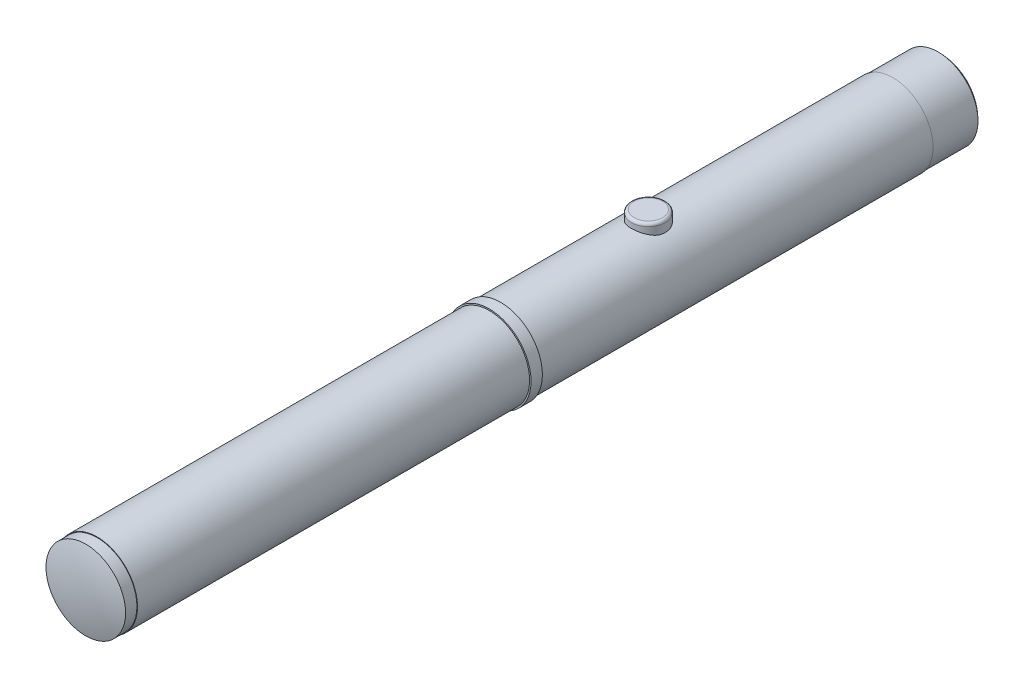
ISO-10303-21;
HEADER;
FILE_DESCRIPTION(('STEP AP214'),'2;1');
FILE_NAME('part.step','',(''),(''),'','','');
FILE_SCHEMA(('AUTOMOTIVE_DESIGN { 1 0 10303 214 1 1 1 1 }'));
ENDSEC;
DATA;
#1=APPLICATION_CONTEXT('core data for automotive mechanical design processes');
#2=APPLICATION_PROTOCOL_DEFINITION('international standard','automotive_design',2000,#1);
#3=PRODUCT_CONTEXT('',#1,'mechanical');
#4=PRODUCT('Part','Part','',(#3));
#5=PRODUCT_RELATED_PRODUCT_CATEGORY('part','',(#4));
#6=PRODUCT_DEFINITION_FORMATION('','',#4);
#7=PRODUCT_DEFINITION_CONTEXT('part definition',#1,'design');
#8=PRODUCT_DEFINITION('design','',#6,#7);
#9=PRODUCT_DEFINITION_SHAPE('','',#8);
#10=(LENGTH_UNIT() NAMED_UNIT(*) SI_UNIT(.MILLI.,.METRE.));
#11=(NAMED_UNIT(*) PLANE_ANGLE_UNIT() SI_UNIT($,.RADIAN.));
#12=(NAMED_UNIT(*) SI_UNIT($,.STERADIAN.) SOLID_ANGLE_UNIT());
#13=UNCERTAINTY_MEASURE_WITH_UNIT(LENGTH_MEASURE(1.E-05),#10,'distance_accuracy_value','');
#14=(GEOMETRIC_REPRESENTATION_CONTEXT(3) GLOBAL_UNCERTAINTY_ASSIGNED_CONTEXT((#13)) GLOBAL_UNIT_ASSIGNED_CONTEXT((#10,
#11,#12)) REPRESENTATION_CONTEXT('',''));
#15=CARTESIAN_POINT('',(0.,0.,0.));
#16=DIRECTION('',(0.,0.,1.));
#17=DIRECTION('',(1.,0.,0.));
#18=AXIS2_PLACEMENT_3D('',#15,#16,#17);
#19=CARTESIAN_POINT('',(0.,0.,140.));
#20=DIRECTION('',(0.,0.,-1.));
#21=DIRECTION('',(-1.,0.,0.));
#22=AXIS2_PLACEMENT_3D('',#19,#20,#21);
#23=CYLINDRICAL_SURFACE('',#22,7.1);
#24=CARTESIAN_POINT('',(0.,0.,69.));
#25=DIRECTION('',(0.,0.,1.));
#26=DIRECTION('',(1.,0.,0.));
#27=AXIS2_PLACEMENT_3D('',#24,#25,#26);
#28=CIRCLE('',#27,7.1);
#29=CARTESIAN_POINT('',(7.1,0.,69.));
#30=VERTEX_POINT('',#29);
#31=EDGE_CURVE('E70',#30,#30,#28,.T.);
#32=ORIENTED_EDGE('',*,*,#31,.F.);
#33=EDGE_LOOP('',(#32));
#34=FACE_BOUND('',#33,.T.);
#35=CARTESIAN_POINT('',(0.,0.,0.));
#36=DIRECTION('',(0.,0.,1.));
#37=DIRECTION('',(1.,0.,0.));
#38=AXIS2_PLACEMENT_3D('',#35,#36,#37);
#39=CIRCLE('',#38,7.1);
#40=CARTESIAN_POINT('',(7.1,0.,0.));
#41=VERTEX_POINT('',#40);
#42=EDGE_CURVE('E94',#41,#41,#39,.T.);
#43=ORIENTED_EDGE('',*,*,#42,.T.);
#44=EDGE_LOOP('',(#43));
#45=FACE_BOUND('',#44,.T.);
#46=DIRECTION('',(0.,0.,-1.));
#47=VECTOR('',#46,1.);
#48=CARTESIAN_POINT('',(2.85657137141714,6.5,140.));
#49=LINE('',#48,#47);
#50=CARTESIAN_POINT('',(2.85657137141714,6.5,43.9165151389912));
#51=VERTEX_POINT('',#50);
#52=CARTESIAN_POINT('',(2.85657137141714,6.5,42.0834848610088));
#53=VERTEX_POINT('',#52);
#54=EDGE_CURVE('E49',#51,#53,#49,.T.);
#55=ORIENTED_EDGE('',*,*,#54,.F.);
#56=CARTESIAN_POINT('',(-2.85657137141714,6.5,43.9165151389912));
#57=CARTESIAN_POINT('',(-2.83046587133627,6.5114659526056,43.9978785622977));
#58=CARTESIAN_POINT('',(-2.80095602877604,6.52425401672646,44.0779016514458));
#59=CARTESIAN_POINT('',(-2.73541718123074,6.55200583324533,44.2347962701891));
#60=CARTESIAN_POINT('',(-2.6993913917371,6.56696851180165,44.3116693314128));
#61=CARTESIAN_POINT('',(-2.58212100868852,6.61435846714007,44.5366102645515));
#62=CARTESIAN_POINT('',(-2.49155349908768,6.64934802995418,44.6794003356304));
#63=CARTESIAN_POINT('',(-2.28843637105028,6.72195321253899,44.9471264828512));
#64=CARTESIAN_POINT('',(-2.17591660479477,6.75956522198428,45.0720864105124));
#65=CARTESIAN_POINT('',(-1.9313148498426,6.83347158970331,45.3017734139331));
#66=CARTESIAN_POINT('',(-1.79922372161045,6.86976532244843,45.406490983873));
#67=CARTESIAN_POINT('',(-1.51466558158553,6.93813643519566,45.5953244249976));
#68=CARTESIAN_POINT('',(-1.36174926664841,6.97007562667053,45.6788166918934));
#69=CARTESIAN_POINT('',(-1.04240926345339,7.0249242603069,45.8184573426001));
#70=CARTESIAN_POINT('',(-0.87599309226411,7.04783868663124,45.8746208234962));
#71=CARTESIAN_POINT('',(-0.544569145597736,7.08092981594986,45.9547963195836));
#72=CARTESIAN_POINT('',(-0.380029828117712,7.09176273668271,45.9804702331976));
#73=CARTESIAN_POINT('',(-0.0486422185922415,7.10176537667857,46.0041968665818));
#74=CARTESIAN_POINT('',(0.118205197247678,7.1009394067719,46.0022597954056));
#75=CARTESIAN_POINT('',(0.438960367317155,7.0881288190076,45.9718225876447));
#76=CARTESIAN_POINT('',(0.593048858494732,7.0768085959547,45.94490393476));
#77=CARTESIAN_POINT('',(0.894290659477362,7.04508296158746,45.8678253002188));
#78=CARTESIAN_POINT('',(1.04144364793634,7.02467712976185,45.8176642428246));
#79=CARTESIAN_POINT('',(1.32816130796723,6.97621504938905,45.6945932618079));
#80=CARTESIAN_POINT('',(1.46750944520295,6.94801097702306,45.621239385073));
#81=CARTESIAN_POINT('',(1.73237109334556,6.88675554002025,45.4542669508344));
#82=CARTESIAN_POINT('',(1.85787540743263,6.85370098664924,45.3606350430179));
#83=CARTESIAN_POINT('',(2.10121098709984,6.78322377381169,45.147775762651));
#84=CARTESIAN_POINT('',(2.21779691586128,6.74565869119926,45.0271714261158));
#85=CARTESIAN_POINT('',(2.42943049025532,6.67236193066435,44.7679935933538));
#86=CARTESIAN_POINT('',(2.52450102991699,6.63662833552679,44.6294394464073));
#87=CARTESIAN_POINT('',(2.65845573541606,6.58373963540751,44.3939963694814));
#88=CARTESIAN_POINT('',(2.70484879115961,6.56474467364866,44.3017213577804));
#89=CARTESIAN_POINT('',(2.78802962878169,6.5298453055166,44.1124631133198));
#90=CARTESIAN_POINT('',(2.82482370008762,6.51393887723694,44.0154830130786));
#91=CARTESIAN_POINT('',(2.85657137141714,6.5,43.9165151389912));
#92=B_SPLINE_CURVE_WITH_KNOTS('',3,(#56,#57,#58,#59,#60,#61,#62,#63,#64,#65,#66,#67,#68,#69,#70,
#71,#72,#73,#74,#75,#76,#77,#78,#79,#80,#81,#82,#83,#84,#85,#86,#87,#88,#89,#90,#91),
.UNSPECIFIED.,.F.,.F.,(4,2,2,2,2,2,2,2,2,2,2,2,2,2,2,2,2,4),(0.,0.258451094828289,
0.51677499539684,1.03216397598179,1.54685692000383,2.06179097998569,2.59045189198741,
3.11882042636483,3.61683080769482,4.11465705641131,4.5829718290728,5.05130827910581,
5.52921578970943,6.00743889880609,6.52087291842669,7.03375800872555,7.34825640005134,
7.66254820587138),.UNSPECIFIED.);
#93=CARTESIAN_POINT('',(-2.85657137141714,6.5,43.9165151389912));
#94=VERTEX_POINT('',#93);
#95=EDGE_CURVE('E58',#94,#51,#92,.T.);
#96=ORIENTED_EDGE('',*,*,#95,.F.);
#97=DIRECTION('',(0.,0.,-1.));
#98=VECTOR('',#97,1.);
#99=CARTESIAN_POINT('',(-2.85657137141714,6.5,140.));
#100=LINE('',#99,#98);
#101=CARTESIAN_POINT('',(-2.85657137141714,6.5,42.0834848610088));
#102=VERTEX_POINT('',#101);
#103=EDGE_CURVE('E60',#102,#94,#100,.F.);
#104=ORIENTED_EDGE('',*,*,#103,.F.);
#105=CARTESIAN_POINT('',(2.85657137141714,6.5,42.0834848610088));
#106=CARTESIAN_POINT('',(2.83046587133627,6.5114659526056,42.0021214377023));
#107=CARTESIAN_POINT('',(2.80095602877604,6.52425401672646,41.9220983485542));
#108=CARTESIAN_POINT('',(2.73541718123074,6.55200583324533,41.7652037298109));
#109=CARTESIAN_POINT('',(2.6993913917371,6.56696851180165,41.6883306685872));
#110=CARTESIAN_POINT('',(2.58212100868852,6.61435846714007,41.4633897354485));
#111=CARTESIAN_POINT('',(2.49155349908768,6.64934802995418,41.3205996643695));
#112=CARTESIAN_POINT('',(2.28843637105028,6.72195321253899,41.0528735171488));
#113=CARTESIAN_POINT('',(2.17591660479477,6.75956522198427,40.9279135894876));
#114=CARTESIAN_POINT('',(1.9313148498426,6.83347158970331,40.6982265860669));
#115=CARTESIAN_POINT('',(1.79922372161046,6.86976532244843,40.593509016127));
#116=CARTESIAN_POINT('',(1.51466558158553,6.93813643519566,40.4046755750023));
#117=CARTESIAN_POINT('',(1.36174926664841,6.97007562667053,40.3211833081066));
#118=CARTESIAN_POINT('',(1.04240926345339,7.0249242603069,40.1815426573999));
#119=CARTESIAN_POINT('',(0.87599309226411,7.04783868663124,40.1253791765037));
#120=CARTESIAN_POINT('',(0.544569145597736,7.08092981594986,40.0452036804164));
#121=CARTESIAN_POINT('',(0.380029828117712,7.09176273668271,40.0195297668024));
#122=CARTESIAN_POINT('',(0.0486422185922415,7.10176537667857,39.9958031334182));
#123=CARTESIAN_POINT('',(-0.118205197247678,7.1009394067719,39.9977402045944));
#124=CARTESIAN_POINT('',(-0.438960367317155,7.0881288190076,40.0281774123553));
#125=CARTESIAN_POINT('',(-0.593048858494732,7.0768085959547,40.05509606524));
#126=CARTESIAN_POINT('',(-0.894290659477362,7.04508296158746,40.1321746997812));
#127=CARTESIAN_POINT('',(-1.04144364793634,7.02467712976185,40.1823357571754));
#128=CARTESIAN_POINT('',(-1.32816130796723,6.97621504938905,40.3054067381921));
#129=CARTESIAN_POINT('',(-1.46750944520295,6.94801097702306,40.378760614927));
#130=CARTESIAN_POINT('',(-1.73237109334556,6.88675554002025,40.5457330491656));
#131=CARTESIAN_POINT('',(-1.85787540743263,6.85370098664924,40.6393649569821));
#132=CARTESIAN_POINT('',(-2.10121098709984,6.78322377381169,40.852224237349));
#133=CARTESIAN_POINT('',(-2.21779691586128,6.74565869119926,40.9728285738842));
#134=CARTESIAN_POINT('',(-2.42943049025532,6.67236193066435,41.2320064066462));
#135=CARTESIAN_POINT('',(-2.52450102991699,6.63662833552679,41.3705605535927));
#136=CARTESIAN_POINT('',(-2.65845573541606,6.58373963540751,41.6060036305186));
#137=CARTESIAN_POINT('',(-2.70484879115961,6.56474467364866,41.6982786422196));
#138=CARTESIAN_POINT('',(-2.78802962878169,6.5298453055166,41.8875368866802));
#139=CARTESIAN_POINT('',(-2.82482370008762,6.51393887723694,41.9845169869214));
#140=CARTESIAN_POINT('',(-2.85657137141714,6.5,42.0834848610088));
#141=B_SPLINE_CURVE_WITH_KNOTS('',3,(#105,#106,#107,#108,#109,#110,#111,#112,#113,#114,#115,
#116,#117,#118,#119,#120,#121,#122,#123,#124,#125,#126,#127,#128,#129,#130,#131,#132,#133,#134,
#135,#136,#137,#138,#139,#140),.UNSPECIFIED.,.F.,.F.,(4,2,2,2,2,2,2,2,2,2,2,2,2,2,2,2,2,4),(0.,
0.258451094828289,0.51677499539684,1.03216397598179,1.54685692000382,2.06179097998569,
2.59045189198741,3.11882042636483,3.61683080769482,4.11465705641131,4.5829718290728,
5.05130827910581,5.52921578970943,6.00743889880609,6.52087291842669,7.03375800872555,
7.34825640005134,7.66254820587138),.UNSPECIFIED.);
#142=EDGE_CURVE('E54',#53,#102,#141,.T.);
#143=ORIENTED_EDGE('',*,*,#142,.F.);
#144=EDGE_LOOP('',(#55,#96,#104,#143));
#145=FACE_BOUND('',#144,.T.);
#146=ADVANCED_FACE('F34',(#34,#45,#145),#23,.T.);
#147=CARTESIAN_POINT('',(0.,0.,0.));
#148=DIRECTION('',(0.,0.,1.));
#149=DIRECTION('',(1.,0.,0.));
#150=AXIS2_PLACEMENT_3D('',#147,#148,#149);
#151=PLANE('',#150);
#152=ORIENTED_EDGE('',*,*,#42,.F.);
#153=EDGE_LOOP('',(#152));
#154=FACE_BOUND('',#153,.T.);
#155=CARTESIAN_POINT('',(0.,0.,0.));
#156=DIRECTION('',(0.,0.,1.));
#157=DIRECTION('',(1.,0.,0.));
#158=AXIS2_PLACEMENT_3D('',#155,#156,#157);
#159=CIRCLE('',#158,7.);
#160=CARTESIAN_POINT('',(7.,0.,0.));
#161=VERTEX_POINT('',#160);
#162=EDGE_CURVE('E103',#161,#161,#159,.F.);
#163=ORIENTED_EDGE('',*,*,#162,.F.);
#164=EDGE_LOOP('',(#163));
#165=FACE_BOUND('',#164,.T.);
#166=ADVANCED_FACE('F155',(#154,#165),#151,.F.);
#167=CARTESIAN_POINT('',(0.,0.,-3.359375));
#168=DIRECTION('',(0.,0.,1.));
#169=DIRECTION('',(1.,0.,0.));
#170=AXIS2_PLACEMENT_3D('',#167,#168,#169);
#171=DEGENERATE_TOROIDAL_SURFACE('',#170,2.25,6.640625,.T.);
#172=CARTESIAN_POINT('',(0.,0.,-8.));
#173=DIRECTION('',(0.,0.,1.));
#174=DIRECTION('',(1.,0.,0.));
#175=AXIS2_PLACEMENT_3D('',#172,#173,#174);
#176=CIRCLE('',#175,7.);
#177=CARTESIAN_POINT('',(7.,0.,-8.));
#178=VERTEX_POINT('',#177);
#179=EDGE_CURVE('E85',#178,#178,#176,.T.);
#180=ORIENTED_EDGE('',*,*,#179,.F.);
#181=EDGE_LOOP('',(#180));
#182=FACE_BOUND('',#181,.T.);
#183=CARTESIAN_POINT('',(0.,0.,-10.));
#184=DIRECTION('',(0.,0.,1.));
#185=DIRECTION('',(1.,0.,0.));
#186=AXIS2_PLACEMENT_3D('',#183,#184,#185);
#187=CIRCLE('',#186,2.25);
#188=CARTESIAN_POINT('',(2.25,0.,-10.));
#189=VERTEX_POINT('',#188);
#190=EDGE_CURVE('E82',#189,#189,#187,.T.);
#191=ORIENTED_EDGE('',*,*,#190,.T.);
#192=EDGE_LOOP('',(#191));
#193=FACE_BOUND('',#192,.T.);
#194=ADVANCED_FACE('F151',(#182,#193),#171,.T.);
#195=CARTESIAN_POINT('',(0.,0.,0.));
#196=DIRECTION('',(0.,0.,1.));
#197=DIRECTION('',(1.,0.,0.));
#198=AXIS2_PLACEMENT_3D('',#195,#196,#197);
#199=CYLINDRICAL_SURFACE('',#198,7.);
#200=ORIENTED_EDGE('',*,*,#162,.T.);
#201=EDGE_LOOP('',(#200));
#202=FACE_BOUND('',#201,.T.);
#203=ORIENTED_EDGE('',*,*,#179,.T.);
#204=EDGE_LOOP('',(#203));
#205=FACE_BOUND('',#204,.T.);
#206=ADVANCED_FACE('F147',(#202,#205),#199,.T.);
#207=CARTESIAN_POINT('',(0.,0.,0.));
#208=DIRECTION('',(0.,0.,1.));
#209=DIRECTION('',(1.,0.,0.));
#210=AXIS2_PLACEMENT_3D('',#207,#208,#209);
#211=CYLINDRICAL_SURFACE('',#210,2.25);
#212=ORIENTED_EDGE('',*,*,#190,.F.);
#213=EDGE_LOOP('',(#212));
#214=FACE_BOUND('',#213,.T.);
#215=CARTESIAN_POINT('',(0.,0.,0.));
#216=DIRECTION('',(0.,0.,1.));
#217=DIRECTION('',(1.,0.,0.));
#218=AXIS2_PLACEMENT_3D('',#215,#216,#217);
#219=CIRCLE('',#218,2.25);
#220=CARTESIAN_POINT('',(2.25,0.,0.));
#221=VERTEX_POINT('',#220);
#222=EDGE_CURVE('E98',#221,#221,#219,.T.);
#223=ORIENTED_EDGE('',*,*,#222,.T.);
#224=EDGE_LOOP('',(#223));
#225=FACE_BOUND('',#224,.T.);
#226=ADVANCED_FACE('F144',(#214,#225),#211,.F.);
#227=ORIENTED_EDGE('',*,*,#222,.F.);
#228=EDGE_LOOP('',(#227));
#229=FACE_BOUND('',#228,.T.);
#230=ADVANCED_FACE('F142',(#229),#151,.F.);
#231=CARTESIAN_POINT('',(-7.35000000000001,0.,69.));
#232=DIRECTION('',(0.,0.,1.));
#233=DIRECTION('',(1.,0.,0.));
#234=AXIS2_PLACEMENT_3D('',#231,#232,#233);
#235=PLANE('',#234);
#236=ORIENTED_EDGE('',*,*,#31,.T.);
#237=EDGE_LOOP('',(#236));
#238=FACE_BOUND('',#237,.T.);
#239=CARTESIAN_POINT('',(0.,0.,69.));
#240=DIRECTION('',(0.,0.,1.));
#241=DIRECTION('',(1.,0.,0.));
#242=AXIS2_PLACEMENT_3D('',#239,#240,#241);
#243=CIRCLE('',#242,7.35000000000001);
#244=CARTESIAN_POINT('',(7.35000000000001,0.,69.));
#245=VERTEX_POINT('',#244);
#246=EDGE_CURVE('E79',#245,#245,#243,.T.);
#247=ORIENTED_EDGE('',*,*,#246,.F.);
#248=EDGE_LOOP('',(#247));
#249=FACE_BOUND('',#248,.T.);
#250=ADVANCED_FACE('F138',(#238,#249),#235,.F.);
#251=CARTESIAN_POINT('',(0.,0.,0.));
#252=DIRECTION('',(0.,0.,1.));
#253=DIRECTION('',(1.,0.,0.));
#254=AXIS2_PLACEMENT_3D('',#251,#252,#253);
#255=CYLINDRICAL_SURFACE('',#254,7.35000000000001);
#256=CARTESIAN_POINT('',(0.,0.,71.));
#257=DIRECTION('',(0.,0.,1.));
#258=DIRECTION('',(1.,0.,0.));
#259=AXIS2_PLACEMENT_3D('',#256,#257,#258);
#260=CIRCLE('',#259,7.35000000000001);
#261=CARTESIAN_POINT('',(7.35000000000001,0.,71.));
#262=VERTEX_POINT('',#261);
#263=EDGE_CURVE('E75',#262,#262,#260,.T.);
#264=ORIENTED_EDGE('',*,*,#263,.F.);
#265=EDGE_LOOP('',(#264));
#266=FACE_BOUND('',#265,.T.);
#267=ORIENTED_EDGE('',*,*,#246,.T.);
#268=EDGE_LOOP('',(#267));
#269=FACE_BOUND('',#268,.T.);
#270=ADVANCED_FACE('F134',(#266,#269),#255,.T.);
#271=CARTESIAN_POINT('',(-7.35000000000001,0.,71.));
#272=DIRECTION('',(0.,0.,-1.));
#273=DIRECTION('',(-1.,0.,0.));
#274=AXIS2_PLACEMENT_3D('',#271,#272,#273);
#275=PLANE('',#274);
#276=CARTESIAN_POINT('',(0.,0.,71.));
#277=DIRECTION('',(0.,0.,-1.));
#278=DIRECTION('',(-1.,0.,0.));
#279=AXIS2_PLACEMENT_3D('',#276,#277,#278);
#280=CIRCLE('',#279,7.1);
#281=CARTESIAN_POINT('',(-7.1,0.,71.));
#282=VERTEX_POINT('',#281);
#283=EDGE_CURVE('E106',#282,#282,#280,.T.);
#284=ORIENTED_EDGE('',*,*,#283,.T.);
#285=EDGE_LOOP('',(#284));
#286=FACE_BOUND('',#285,.T.);
#287=ORIENTED_EDGE('',*,*,#263,.T.);
#288=EDGE_LOOP('',(#287));
#289=FACE_BOUND('',#288,.T.);
#290=ADVANCED_FACE('F129',(#286,#289),#275,.F.);
#291=CARTESIAN_POINT('',(0.,0.,118.));
#292=DIRECTION('',(0.,0.,1.));
#293=DIRECTION('',(-1.,0.,0.));
#294=AXIS2_PLACEMENT_3D('',#291,#292,#293);
#295=SPHERICAL_SURFACE('',#294,25.);
#296=CARTESIAN_POINT('',(0.,0.,142.));
#297=DIRECTION('',(0.,0.,1.));
#298=DIRECTION('',(1.,0.,0.));
#299=AXIS2_PLACEMENT_3D('',#296,#297,#298);
#300=CIRCLE('',#299,7.);
#301=CARTESIAN_POINT('',(7.,0.,142.));
#302=VERTEX_POINT('',#301);
#303=EDGE_CURVE('E91',#302,#302,#300,.T.);
#304=ORIENTED_EDGE('',*,*,#303,.T.);
#305=EDGE_LOOP('',(#304));
#306=FACE_BOUND('',#305,.T.);
#307=ADVANCED_FACE('F133',(#306),#295,.T.);
#308=CARTESIAN_POINT('',(0.,0.,0.));
#309=DIRECTION('',(0.,0.,1.));
#310=DIRECTION('',(1.,0.,0.));
#311=AXIS2_PLACEMENT_3D('',#308,#309,#310);
#312=CYLINDRICAL_SURFACE('',#311,7.);
#313=ORIENTED_EDGE('',*,*,#303,.F.);
#314=EDGE_LOOP('',(#313));
#315=FACE_BOUND('',#314,.T.);
#316=CARTESIAN_POINT('',(0.,0.,140.));
#317=DIRECTION('',(0.,0.,1.));
#318=DIRECTION('',(1.,0.,0.));
#319=AXIS2_PLACEMENT_3D('',#316,#317,#318);
#320=CIRCLE('',#319,7.);
#321=CARTESIAN_POINT('',(7.,0.,140.));
#322=VERTEX_POINT('',#321);
#323=EDGE_CURVE('E88',#322,#322,#320,.T.);
#324=ORIENTED_EDGE('',*,*,#323,.T.);
#325=EDGE_LOOP('',(#324));
#326=FACE_BOUND('',#325,.T.);
#327=ADVANCED_FACE('F157',(#315,#326),#312,.T.);
#328=CARTESIAN_POINT('',(0.,0.,140.));
#329=DIRECTION('',(0.,0.,1.));
#330=DIRECTION('',(1.,0.,0.));
#331=AXIS2_PLACEMENT_3D('',#328,#329,#330);
#332=PLANE('',#331);
#333=ORIENTED_EDGE('',*,*,#323,.F.);
#334=EDGE_LOOP('',(#333));
#335=FACE_BOUND('',#334,.T.);
#336=CARTESIAN_POINT('',(0.,0.,140.));
#337=DIRECTION('',(0.,0.,1.));
#338=DIRECTION('',(1.,0.,0.));
#339=AXIS2_PLACEMENT_3D('',#336,#337,#338);
#340=CIRCLE('',#339,7.1);
#341=CARTESIAN_POINT('',(7.1,0.,140.));
#342=VERTEX_POINT('',#341);
#343=EDGE_CURVE('E95',#342,#342,#340,.T.);
#344=ORIENTED_EDGE('',*,*,#343,.T.);
#345=EDGE_LOOP('',(#344));
#346=FACE_BOUND('',#345,.T.);
#347=ADVANCED_FACE('F160',(#335,#346),#332,.T.);
#348=ORIENTED_EDGE('',*,*,#343,.F.);
#349=EDGE_LOOP('',(#348));
#350=FACE_BOUND('',#349,.T.);
#351=ORIENTED_EDGE('',*,*,#283,.F.);
#352=EDGE_LOOP('',(#351));
#353=FACE_BOUND('',#352,.T.);
#354=ADVANCED_FACE('F126',(#350,#353),#23,.T.);
#355=CARTESIAN_POINT('',(0.,8.5,43.));
#356=DIRECTION('',(0.,-1.,0.));
#357=DIRECTION('',(0.,0.,-1.));
#358=AXIS2_PLACEMENT_3D('',#355,#356,#357);
#359=CYLINDRICAL_SURFACE('',#358,3.);
#360=CARTESIAN_POINT('',(0.,8.,43.));
#361=DIRECTION('',(0.,1.,0.));
#362=DIRECTION('',(0.,0.,1.));
#363=AXIS2_PLACEMENT_3D('',#360,#361,#362);
#364=CIRCLE('',#363,3.);
#365=CARTESIAN_POINT('',(0.,8.,46.));
#366=VERTEX_POINT('',#365);
#367=EDGE_CURVE('E11',#366,#366,#364,.F.);
#368=ORIENTED_EDGE('',*,*,#367,.T.);
#369=EDGE_LOOP('',(#368));
#370=FACE_BOUND('',#369,.T.);
#371=CARTESIAN_POINT('',(0.,6.5,43.));
#372=DIRECTION('',(0.,1.,0.));
#373=DIRECTION('',(0.,0.,1.));
#374=AXIS2_PLACEMENT_3D('',#371,#372,#373);
#375=CIRCLE('',#374,3.);
#376=EDGE_CURVE('E69',#102,#94,#375,.T.);
#377=ORIENTED_EDGE('',*,*,#376,.T.);
#378=ORIENTED_EDGE('',*,*,#95,.T.);
#379=EDGE_CURVE('E73',#51,#53,#375,.T.);
#380=ORIENTED_EDGE('',*,*,#379,.T.);
#381=ORIENTED_EDGE('',*,*,#142,.T.);
#382=EDGE_LOOP('',(#377,#378,#380,#381));
#383=FACE_BOUND('',#382,.T.);
#384=ADVANCED_FACE('F72',(#370,#383),#359,.T.);
#385=CARTESIAN_POINT('',(0.,6.5,43.));
#386=DIRECTION('',(0.,1.,0.));
#387=DIRECTION('',(0.,0.,1.));
#388=AXIS2_PLACEMENT_3D('',#385,#386,#387);
#389=PLANE('',#388);
#390=ORIENTED_EDGE('',*,*,#379,.F.);
#391=ORIENTED_EDGE('',*,*,#54,.T.);
#392=EDGE_LOOP('',(#390,#391));
#393=FACE_BOUND('',#392,.T.);
#394=ADVANCED_FACE('F125',(#393),#389,.F.);
#395=ORIENTED_EDGE('',*,*,#376,.F.);
#396=ORIENTED_EDGE('',*,*,#103,.T.);
#397=EDGE_LOOP('',(#395,#396));
#398=FACE_BOUND('',#397,.T.);
#399=ADVANCED_FACE('F68',(#398),#389,.F.);
#400=CARTESIAN_POINT('',(0.,8.5,43.));
#401=DIRECTION('',(0.,1.,0.));
#402=DIRECTION('',(0.,0.,1.));
#403=AXIS2_PLACEMENT_3D('',#400,#401,#402);
#404=PLANE('',#403);
#405=CARTESIAN_POINT('',(0.,8.5,43.));
#406=DIRECTION('',(0.,1.,0.));
#407=DIRECTION('',(0.,0.,1.));
#408=AXIS2_PLACEMENT_3D('',#405,#406,#407);
#409=CIRCLE('',#408,2.5);
#410=CARTESIAN_POINT('',(0.,8.5,45.5));
#411=VERTEX_POINT('',#410);
#412=EDGE_CURVE('E42',#411,#411,#409,.T.);
#413=ORIENTED_EDGE('',*,*,#412,.T.);
#414=EDGE_LOOP('',(#413));
#415=FACE_BOUND('',#414,.T.);
#416=ADVANCED_FACE('F232',(#415),#404,.T.);
#417=CARTESIAN_POINT('',(0.,8.,43.));
#418=DIRECTION('',(0.,1.,0.));
#419=DIRECTION('',(0.,0.,1.));
#420=AXIS2_PLACEMENT_3D('',#417,#418,#419);
#421=TOROIDAL_SURFACE('',#420,2.5,0.5);
#422=ORIENTED_EDGE('',*,*,#367,.F.);
#423=EDGE_LOOP('',(#422));
#424=FACE_BOUND('',#423,.T.);
#425=ORIENTED_EDGE('',*,*,#412,.F.);
#426=EDGE_LOOP('',(#425));
#427=FACE_BOUND('',#426,.T.);
#428=ADVANCED_FACE('F36',(#424,#427),#421,.T.);
#429=CLOSED_SHELL('',(#146,#166,#194,#206,#226,#230,#250,#270,#290,#307,#327,#347,#354,#384,
#394,#399,#416,#428));
#430=MANIFOLD_SOLID_BREP('B2',#429);
#431=ADVANCED_BREP_SHAPE_REPRESENTATION('',(#18,#430),#14);
#432=SHAPE_DEFINITION_REPRESENTATION(#9,#431);
ENDSEC;
END-ISO-10303-21;
